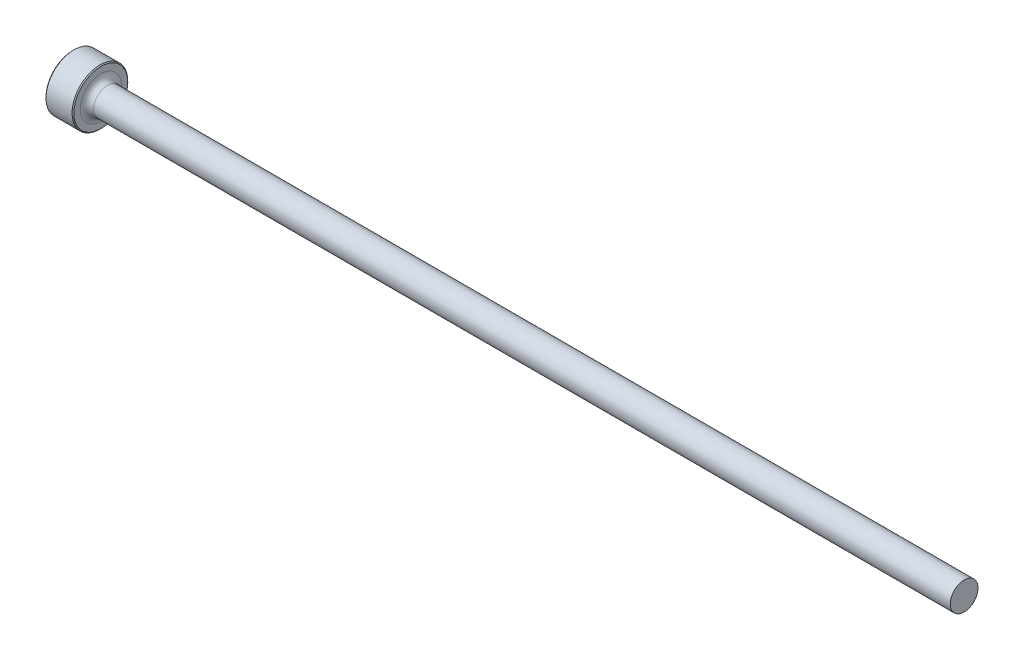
ISO-10303-21;
HEADER;
FILE_DESCRIPTION(('STEP AP214'),'2;1');
FILE_NAME('part.step','',(''),(''),'','','');
FILE_SCHEMA(('AUTOMOTIVE_DESIGN { 1 0 10303 214 1 1 1 1 }'));
ENDSEC;
DATA;
#1=APPLICATION_CONTEXT('core data for automotive mechanical design processes');
#2=APPLICATION_PROTOCOL_DEFINITION('international standard','automotive_design',2000,#1);
#3=PRODUCT_CONTEXT('',#1,'mechanical');
#4=PRODUCT('Part','Part','',(#3));
#5=PRODUCT_RELATED_PRODUCT_CATEGORY('part','',(#4));
#6=PRODUCT_DEFINITION_FORMATION('','',#4);
#7=PRODUCT_DEFINITION_CONTEXT('part definition',#1,'design');
#8=PRODUCT_DEFINITION('design','',#6,#7);
#9=PRODUCT_DEFINITION_SHAPE('','',#8);
#10=(LENGTH_UNIT() NAMED_UNIT(*) SI_UNIT(.MILLI.,.METRE.));
#11=(NAMED_UNIT(*) PLANE_ANGLE_UNIT() SI_UNIT($,.RADIAN.));
#12=(NAMED_UNIT(*) SI_UNIT($,.STERADIAN.) SOLID_ANGLE_UNIT());
#13=UNCERTAINTY_MEASURE_WITH_UNIT(LENGTH_MEASURE(1.E-05),#10,'distance_accuracy_value','');
#14=(GEOMETRIC_REPRESENTATION_CONTEXT(3) GLOBAL_UNCERTAINTY_ASSIGNED_CONTEXT((#13)) GLOBAL_UNIT_ASSIGNED_CONTEXT((#10,
#11,#12)) REPRESENTATION_CONTEXT('',''));
#15=CARTESIAN_POINT('',(0.,0.,0.));
#16=DIRECTION('',(0.,0.,1.));
#17=DIRECTION('',(1.,0.,0.));
#18=AXIS2_PLACEMENT_3D('',#15,#16,#17);
#19=CARTESIAN_POINT('',(101.6,1.58368999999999,0.));
#20=DIRECTION('',(1.,0.,0.));
#21=DIRECTION('',(0.,1.,0.));
#22=AXIS2_PLACEMENT_3D('',#19,#20,#21);
#23=PLANE('',#22);
#24=CARTESIAN_POINT('',(101.6,0.,0.));
#25=DIRECTION('',(1.,0.,0.));
#26=DIRECTION('',(0.,1.,0.));
#27=AXIS2_PLACEMENT_3D('',#24,#25,#26);
#28=CIRCLE('',#27,1.58369);
#29=CARTESIAN_POINT('',(101.6,1.58368999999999,0.));
#30=VERTEX_POINT('',#29);
#31=EDGE_CURVE('E50',#30,#30,#28,.T.);
#32=ORIENTED_EDGE('',*,*,#31,.T.);
#33=EDGE_LOOP('',(#32));
#34=FACE_BOUND('',#33,.T.);
#35=ADVANCED_FACE('F30',(#34),#23,.T.);
#36=CARTESIAN_POINT('',(101.6,0.,0.));
#37=DIRECTION('',(1.,0.,0.));
#38=DIRECTION('',(0.,1.,0.));
#39=AXIS2_PLACEMENT_3D('',#36,#37,#38);
#40=CYLINDRICAL_SURFACE('',#39,1.58369);
#41=CARTESIAN_POINT('',(3.937,0.,0.));
#42=DIRECTION('',(1.,0.,0.));
#43=DIRECTION('',(0.,1.,0.));
#44=AXIS2_PLACEMENT_3D('',#41,#42,#43);
#45=CIRCLE('',#44,1.58368999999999);
#46=CARTESIAN_POINT('',(3.937,1.58368999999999,0.));
#47=VERTEX_POINT('',#46);
#48=EDGE_CURVE('E53',#47,#47,#45,.T.);
#49=ORIENTED_EDGE('',*,*,#48,.T.);
#50=EDGE_LOOP('',(#49));
#51=FACE_BOUND('',#50,.T.);
#52=ORIENTED_EDGE('',*,*,#31,.F.);
#53=EDGE_LOOP('',(#52));
#54=FACE_BOUND('',#53,.T.);
#55=ADVANCED_FACE('F74',(#51,#54),#40,.T.);
#56=CARTESIAN_POINT('',(3.937,0.,0.));
#57=DIRECTION('',(1.,0.,0.));
#58=DIRECTION('',(0.,1.,0.));
#59=AXIS2_PLACEMENT_3D('',#56,#57,#58);
#60=TOROIDAL_SURFACE('',#59,2.34568999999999,0.762);
#61=CARTESIAN_POINT('',(3.175,0.,0.));
#62=DIRECTION('',(1.,0.,0.));
#63=DIRECTION('',(0.,1.,0.));
#64=AXIS2_PLACEMENT_3D('',#61,#62,#63);
#65=CIRCLE('',#64,2.34568999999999);
#66=CARTESIAN_POINT('',(3.175,2.34568999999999,0.));
#67=VERTEX_POINT('',#66);
#68=EDGE_CURVE('E56',#67,#67,#65,.T.);
#69=ORIENTED_EDGE('',*,*,#68,.T.);
#70=EDGE_LOOP('',(#69));
#71=FACE_BOUND('',#70,.T.);
#72=ORIENTED_EDGE('',*,*,#48,.F.);
#73=EDGE_LOOP('',(#72));
#74=FACE_BOUND('',#73,.T.);
#75=ADVANCED_FACE('F60',(#71,#74),#60,.F.);
#76=CARTESIAN_POINT('',(3.175,3.175,0.));
#77=DIRECTION('',(1.,0.,0.));
#78=DIRECTION('',(0.,1.,0.));
#79=AXIS2_PLACEMENT_3D('',#76,#77,#78);
#80=PLANE('',#79);
#81=CARTESIAN_POINT('',(3.175,0.,0.));
#82=DIRECTION('',(1.,0.,0.));
#83=DIRECTION('',(0.,1.,0.));
#84=AXIS2_PLACEMENT_3D('',#81,#82,#83);
#85=CIRCLE('',#84,3.07339999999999);
#86=CARTESIAN_POINT('',(3.175,3.07339999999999,0.));
#87=VERTEX_POINT('',#86);
#88=EDGE_CURVE('E10',#87,#87,#85,.T.);
#89=ORIENTED_EDGE('',*,*,#88,.T.);
#90=EDGE_LOOP('',(#89));
#91=FACE_BOUND('',#90,.T.);
#92=ORIENTED_EDGE('',*,*,#68,.F.);
#93=EDGE_LOOP('',(#92));
#94=FACE_BOUND('',#93,.T.);
#95=ADVANCED_FACE('F63',(#91,#94),#80,.T.);
#96=CARTESIAN_POINT('',(101.6,0.,0.));
#97=DIRECTION('',(1.,0.,0.));
#98=DIRECTION('',(0.,1.,0.));
#99=AXIS2_PLACEMENT_3D('',#96,#97,#98);
#100=CYLINDRICAL_SURFACE('',#99,3.175);
#101=CARTESIAN_POINT('',(0.101599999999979,0.,0.));
#102=DIRECTION('',(-1.,0.,0.));
#103=DIRECTION('',(0.,-1.,0.));
#104=AXIS2_PLACEMENT_3D('',#101,#102,#103);
#105=CIRCLE('',#104,3.175);
#106=CARTESIAN_POINT('',(0.101599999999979,-3.175,0.));
#107=VERTEX_POINT('',#106);
#108=EDGE_CURVE('E41',#107,#107,#105,.F.);
#109=ORIENTED_EDGE('',*,*,#108,.T.);
#110=EDGE_LOOP('',(#109));
#111=FACE_BOUND('',#110,.T.);
#112=CARTESIAN_POINT('',(3.07339999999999,0.,0.));
#113=DIRECTION('',(1.,0.,0.));
#114=DIRECTION('',(0.,1.,0.));
#115=AXIS2_PLACEMENT_3D('',#112,#113,#114);
#116=CIRCLE('',#115,3.175);
#117=CARTESIAN_POINT('',(3.07339999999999,3.175,0.));
#118=VERTEX_POINT('',#117);
#119=EDGE_CURVE('E45',#118,#118,#116,.F.);
#120=ORIENTED_EDGE('',*,*,#119,.T.);
#121=EDGE_LOOP('',(#120));
#122=FACE_BOUND('',#121,.T.);
#123=ADVANCED_FACE('F65',(#111,#122),#100,.T.);
#124=CARTESIAN_POINT('',(0.,0.,0.));
#125=DIRECTION('',(-1.,0.,0.));
#126=DIRECTION('',(0.,-1.,0.));
#127=AXIS2_PLACEMENT_3D('',#124,#125,#126);
#128=PLANE('',#127);
#129=CARTESIAN_POINT('',(0.,0.,0.));
#130=DIRECTION('',(-1.,0.,0.));
#131=DIRECTION('',(0.,-1.,0.));
#132=AXIS2_PLACEMENT_3D('',#129,#130,#131);
#133=CIRCLE('',#132,3.0734);
#134=CARTESIAN_POINT('',(0.,-3.0734,0.));
#135=VERTEX_POINT('',#134);
#136=EDGE_CURVE('E37',#135,#135,#133,.T.);
#137=ORIENTED_EDGE('',*,*,#136,.T.);
#138=EDGE_LOOP('',(#137));
#139=FACE_BOUND('',#138,.T.);
#140=ADVANCED_FACE('F71',(#139),#128,.T.);
#141=CARTESIAN_POINT('',(0.101599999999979,0.,0.));
#142=DIRECTION('',(1.,0.,0.));
#143=DIRECTION('',(0.,1.,0.));
#144=AXIS2_PLACEMENT_3D('',#141,#142,#143);
#145=CONICAL_SURFACE('',#144,3.175,0.785398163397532);
#146=ORIENTED_EDGE('',*,*,#136,.F.);
#147=EDGE_LOOP('',(#146));
#148=FACE_BOUND('',#147,.T.);
#149=ORIENTED_EDGE('',*,*,#108,.F.);
#150=EDGE_LOOP('',(#149));
#151=FACE_BOUND('',#150,.T.);
#152=ADVANCED_FACE('F84',(#148,#151),#145,.T.);
#153=CARTESIAN_POINT('',(3.175,0.,0.));
#154=DIRECTION('',(-1.,0.,0.));
#155=DIRECTION('',(0.,-1.,0.));
#156=AXIS2_PLACEMENT_3D('',#153,#154,#155);
#157=CONICAL_SURFACE('',#156,3.07339999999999,0.785398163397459);
#158=ORIENTED_EDGE('',*,*,#119,.F.);
#159=EDGE_LOOP('',(#158));
#160=FACE_BOUND('',#159,.T.);
#161=ORIENTED_EDGE('',*,*,#88,.F.);
#162=EDGE_LOOP('',(#161));
#163=FACE_BOUND('',#162,.T.);
#164=ADVANCED_FACE('F32',(#160,#163),#157,.T.);
#165=CLOSED_SHELL('',(#35,#55,#75,#95,#123,#140,#152,#164));
#166=MANIFOLD_SOLID_BREP('B2',#165);
#167=ADVANCED_BREP_SHAPE_REPRESENTATION('',(#18,#166),#14);
#168=SHAPE_DEFINITION_REPRESENTATION(#9,#167);
ENDSEC;
END-ISO-10303-21;
